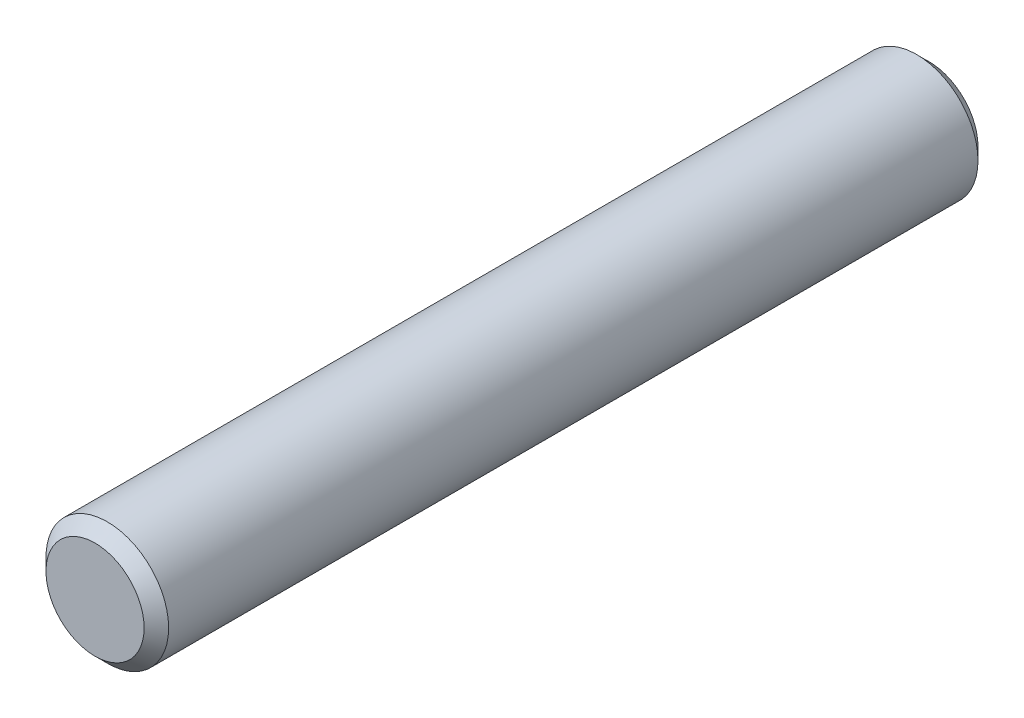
from build123d import *

# Parameters (mm, degrees)
SCHIZZO1_R                   = 5
ESTRUSIONE_ESTRUSIONE1_DEPTH = 68
SMUSSO1_SIZE                 = 1
SMUSSO2_SIZE                 = 1


with BuildPart() as part:
    # Schizzo1 → Estrusione-Estrusione1 (new body)
    with BuildSketch(Plane.XY):
        Circle(SCHIZZO1_R)
    extrude(amount=ESTRUSIONE_ESTRUSIONE1_DEPTH)

    # Smusso1
    smusso1_edges = [part.edges().sort_by_distance(p)[0] for p in [
        (-5, 0, 0),
    ]]
    chamfer(smusso1_edges, length=SMUSSO1_SIZE)

    # Smusso2
    smusso2_edges = [part.edges().sort_by_distance(p)[0] for p in [
        (-5, 0, 68),
    ]]
    chamfer(smusso2_edges, length=SMUSSO2_SIZE)


solid = part.part
